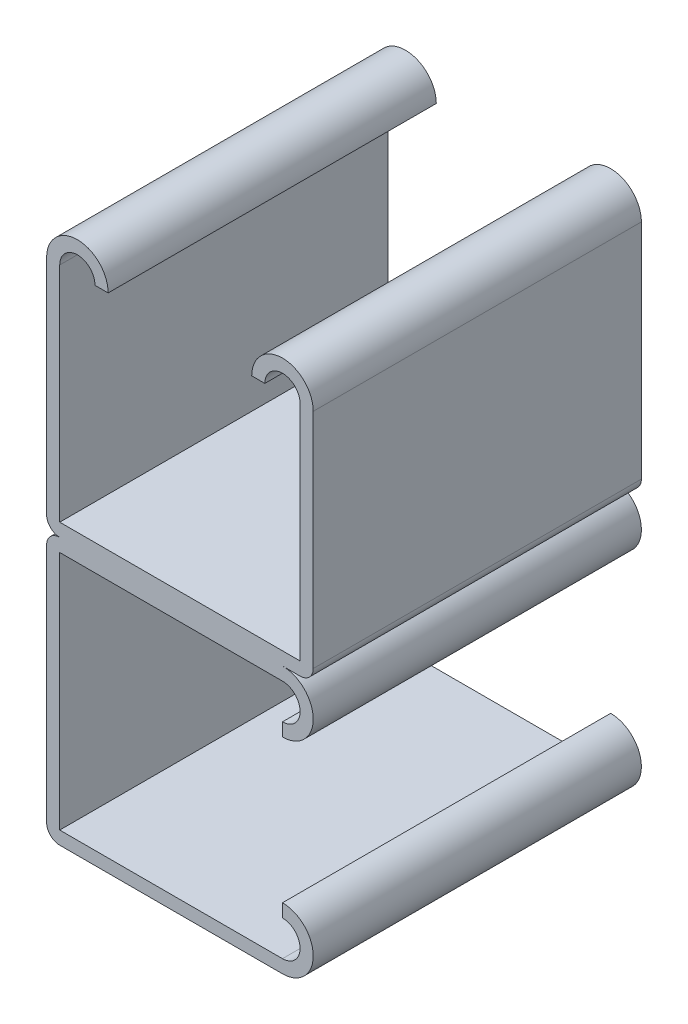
from build123d import *

# Parameters (mm, degrees)
BASE_EXTRUDE_DEPTH = 12.7
CIRPATTERN1_COUNT  = 2
CIRPATTERN1_ANGLE  = 270


with BuildPart() as part:
    # Sketch1 → Base-Extrude (new, symmetric)
    with BuildSketch(Plane.XY):
        with BuildLine():
            Line((0, 18.25625), (0, 1.016))
            ThreePointArc((0, 1.016), (0.29757951, 0.29757951), (1.016, 0))
            Line((1.016, 0), (19.6215, 0))
            ThreePointArc((19.6215, 0), (20.33992049, 0.29757951), (20.6375, 1.016))
            Line((20.6375, 1.016), (20.6375, 18.25625))
            ThreePointArc((20.6375, 18.25625), (18.25625, 20.6375), (15.875, 18.25625))
            Line((15.875, 18.25625), (16.891, 18.25625))
            ThreePointArc((16.891, 18.25625), (18.25625, 19.6215), (19.6215, 18.25625))
            Line((19.6215, 18.25625), (19.6215, 1.016))
            Line((19.6215, 1.016), (1.016, 1.016))
            Line((1.016, 1.016), (1.016, 18.25625))
            ThreePointArc((1.016, 18.25625), (2.38125, 19.6215), (3.7465, 18.25625))
            Line((3.7465, 18.25625), (4.7625, 18.25625))
            ThreePointArc((4.7625, 18.25625), (2.38125, 20.6375), (0, 18.25625))
        make_face()
    base_extrude = extrude(amount=BASE_EXTRUDE_DEPTH, both=True)

    # CirPattern1: Base-Extrude ×2 about axis
    cirpattern1_axis = Axis((0, 0, 0), (0, 0, 1))
    for i in range(1, CIRPATTERN1_COUNT):
        add(base_extrude.rotate(cirpattern1_axis, i * CIRPATTERN1_ANGLE / (CIRPATTERN1_COUNT - 1)))


solid = part.part
